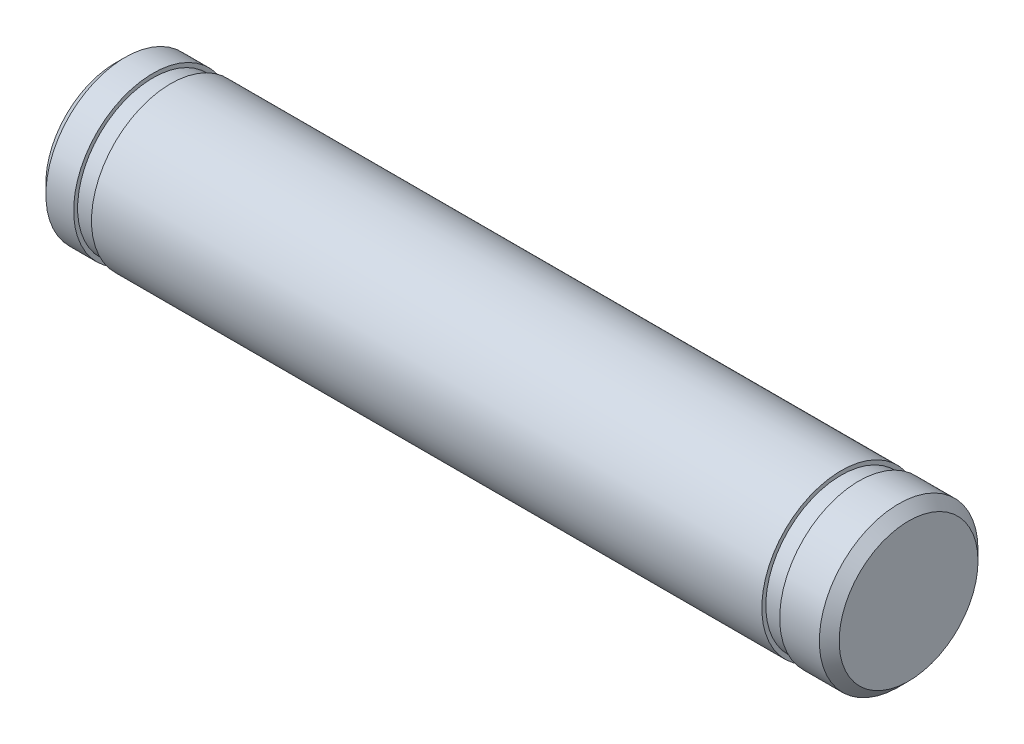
ISO-10303-21;
HEADER;
FILE_DESCRIPTION(('STEP AP214'),'2;1');
FILE_NAME('part.step','',(''),(''),'','','');
FILE_SCHEMA(('AUTOMOTIVE_DESIGN { 1 0 10303 214 1 1 1 1 }'));
ENDSEC;
DATA;
#1=APPLICATION_CONTEXT('core data for automotive mechanical design processes');
#2=APPLICATION_PROTOCOL_DEFINITION('international standard','automotive_design',2000,#1);
#3=PRODUCT_CONTEXT('',#1,'mechanical');
#4=PRODUCT('Part','Part','',(#3));
#5=PRODUCT_RELATED_PRODUCT_CATEGORY('part','',(#4));
#6=PRODUCT_DEFINITION_FORMATION('','',#4);
#7=PRODUCT_DEFINITION_CONTEXT('part definition',#1,'design');
#8=PRODUCT_DEFINITION('design','',#6,#7);
#9=PRODUCT_DEFINITION_SHAPE('','',#8);
#10=(LENGTH_UNIT() NAMED_UNIT(*) SI_UNIT(.MILLI.,.METRE.));
#11=(NAMED_UNIT(*) PLANE_ANGLE_UNIT() SI_UNIT($,.RADIAN.));
#12=(NAMED_UNIT(*) SI_UNIT($,.STERADIAN.) SOLID_ANGLE_UNIT());
#13=UNCERTAINTY_MEASURE_WITH_UNIT(LENGTH_MEASURE(1.E-05),#10,'distance_accuracy_value','');
#14=(GEOMETRIC_REPRESENTATION_CONTEXT(3) GLOBAL_UNCERTAINTY_ASSIGNED_CONTEXT((#13)) GLOBAL_UNIT_ASSIGNED_CONTEXT((#10,
#11,#12)) REPRESENTATION_CONTEXT('',''));
#15=CARTESIAN_POINT('',(0.,0.,0.));
#16=DIRECTION('',(0.,0.,1.));
#17=DIRECTION('',(1.,0.,0.));
#18=AXIS2_PLACEMENT_3D('',#15,#16,#17);
#19=CARTESIAN_POINT('',(0.,0.,0.));
#20=DIRECTION('',(-1.,0.,0.));
#21=DIRECTION('',(0.,0.,1.));
#22=AXIS2_PLACEMENT_3D('',#19,#20,#21);
#23=PLANE('',#22);
#24=CARTESIAN_POINT('',(0.,0.,0.));
#25=DIRECTION('',(1.,0.,0.));
#26=DIRECTION('',(0.,0.,-1.));
#27=AXIS2_PLACEMENT_3D('',#24,#25,#26);
#28=CIRCLE('',#27,3.49999999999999);
#29=CARTESIAN_POINT('',(0.,0.,-3.49999999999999));
#30=VERTEX_POINT('',#29);
#31=EDGE_CURVE('E10',#30,#30,#28,.T.);
#32=ORIENTED_EDGE('',*,*,#31,.F.);
#33=EDGE_LOOP('',(#32));
#34=FACE_BOUND('',#33,.T.);
#35=ADVANCED_FACE('F30',(#34),#23,.T.);
#36=CARTESIAN_POINT('',(0.499999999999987,0.,0.));
#37=DIRECTION('',(1.,0.,0.));
#38=DIRECTION('',(0.,0.,-1.));
#39=AXIS2_PLACEMENT_3D('',#36,#37,#38);
#40=CONICAL_SURFACE('',#39,3.99999999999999,0.785398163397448);
#41=ORIENTED_EDGE('',*,*,#31,.T.);
#42=EDGE_LOOP('',(#41));
#43=FACE_BOUND('',#42,.T.);
#44=CARTESIAN_POINT('',(0.499999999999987,0.,0.));
#45=DIRECTION('',(1.,0.,0.));
#46=DIRECTION('',(0.,0.,-1.));
#47=AXIS2_PLACEMENT_3D('',#44,#45,#46);
#48=CIRCLE('',#47,3.99999999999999);
#49=CARTESIAN_POINT('',(0.499999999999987,0.,-3.99999999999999));
#50=VERTEX_POINT('',#49);
#51=EDGE_CURVE('E36',#50,#50,#48,.T.);
#52=ORIENTED_EDGE('',*,*,#51,.F.);
#53=EDGE_LOOP('',(#52));
#54=FACE_BOUND('',#53,.T.);
#55=ADVANCED_FACE('F90',(#43,#54),#40,.T.);
#56=CARTESIAN_POINT('',(124.297135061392,0.,0.));
#57=DIRECTION('',(1.,0.,0.));
#58=DIRECTION('',(0.,0.,-1.));
#59=AXIS2_PLACEMENT_3D('',#56,#57,#58);
#60=CYLINDRICAL_SURFACE('',#59,3.99999999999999);
#61=ORIENTED_EDGE('',*,*,#51,.T.);
#62=EDGE_LOOP('',(#61));
#63=FACE_BOUND('',#62,.T.);
#64=CARTESIAN_POINT('',(1.89999999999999,0.,0.));
#65=DIRECTION('',(1.,0.,0.));
#66=DIRECTION('',(0.,0.,-1.));
#67=AXIS2_PLACEMENT_3D('',#64,#65,#66);
#68=CIRCLE('',#67,3.99999999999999);
#69=CARTESIAN_POINT('',(1.89999999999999,0.,-3.99999999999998));
#70=VERTEX_POINT('',#69);
#71=EDGE_CURVE('E40',#70,#70,#68,.T.);
#72=ORIENTED_EDGE('',*,*,#71,.F.);
#73=EDGE_LOOP('',(#72));
#74=FACE_BOUND('',#73,.T.);
#75=ADVANCED_FACE('F95',(#63,#74),#60,.T.);
#76=CARTESIAN_POINT('',(1.9,4.,0.));
#77=DIRECTION('',(1.,0.,0.));
#78=DIRECTION('',(0.,0.,-1.));
#79=AXIS2_PLACEMENT_3D('',#76,#77,#78);
#80=PLANE('',#79);
#81=ORIENTED_EDGE('',*,*,#71,.T.);
#82=EDGE_LOOP('',(#81));
#83=FACE_BOUND('',#82,.T.);
#84=CARTESIAN_POINT('',(1.89999999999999,0.,0.));
#85=DIRECTION('',(1.,0.,0.));
#86=DIRECTION('',(0.,0.,-1.));
#87=AXIS2_PLACEMENT_3D('',#84,#85,#86);
#88=CIRCLE('',#87,3.79999999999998);
#89=CARTESIAN_POINT('',(1.89999999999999,0.,-3.79999999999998));
#90=VERTEX_POINT('',#89);
#91=EDGE_CURVE('E44',#90,#90,#88,.T.);
#92=ORIENTED_EDGE('',*,*,#91,.F.);
#93=EDGE_LOOP('',(#92));
#94=FACE_BOUND('',#93,.T.);
#95=ADVANCED_FACE('F99',(#83,#94),#80,.T.);
#96=CARTESIAN_POINT('',(124.297135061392,0.,0.));
#97=DIRECTION('',(1.,0.,0.));
#98=DIRECTION('',(0.,0.,-1.));
#99=AXIS2_PLACEMENT_3D('',#96,#97,#98);
#100=CYLINDRICAL_SURFACE('',#99,3.79999999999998);
#101=ORIENTED_EDGE('',*,*,#91,.T.);
#102=EDGE_LOOP('',(#101));
#103=FACE_BOUND('',#102,.T.);
#104=CARTESIAN_POINT('',(2.79999999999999,0.,-2.22044604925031E-13));
#105=DIRECTION('',(1.,0.,0.));
#106=DIRECTION('',(0.,0.,-1.));
#107=AXIS2_PLACEMENT_3D('',#104,#105,#106);
#108=CIRCLE('',#107,3.79999999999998);
#109=CARTESIAN_POINT('',(2.79999999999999,0.,-3.80000000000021));
#110=VERTEX_POINT('',#109);
#111=EDGE_CURVE('E49',#110,#110,#108,.T.);
#112=ORIENTED_EDGE('',*,*,#111,.F.);
#113=EDGE_LOOP('',(#112));
#114=FACE_BOUND('',#113,.T.);
#115=ADVANCED_FACE('F105',(#103,#114),#100,.T.);
#116=CARTESIAN_POINT('',(2.79999999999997,3.99999999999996,-2.22044604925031E-13));
#117=DIRECTION('',(-1.,0.,0.));
#118=DIRECTION('',(0.,0.,1.));
#119=AXIS2_PLACEMENT_3D('',#116,#117,#118);
#120=PLANE('',#119);
#121=ORIENTED_EDGE('',*,*,#111,.T.);
#122=EDGE_LOOP('',(#121));
#123=FACE_BOUND('',#122,.T.);
#124=CARTESIAN_POINT('',(2.79999999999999,0.,-2.22044604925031E-13));
#125=DIRECTION('',(1.,0.,0.));
#126=DIRECTION('',(0.,0.,-1.));
#127=AXIS2_PLACEMENT_3D('',#124,#125,#126);
#128=CIRCLE('',#127,3.99999999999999);
#129=CARTESIAN_POINT('',(2.79999999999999,0.,-4.00000000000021));
#130=VERTEX_POINT('',#129);
#131=EDGE_CURVE('E52',#130,#130,#128,.T.);
#132=ORIENTED_EDGE('',*,*,#131,.F.);
#133=EDGE_LOOP('',(#132));
#134=FACE_BOUND('',#133,.T.);
#135=ADVANCED_FACE('F109',(#123,#134),#120,.T.);
#136=CARTESIAN_POINT('',(124.297135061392,0.,0.));
#137=DIRECTION('',(1.,0.,0.));
#138=DIRECTION('',(0.,0.,-1.));
#139=AXIS2_PLACEMENT_3D('',#136,#137,#138);
#140=CYLINDRICAL_SURFACE('',#139,3.99999999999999);
#141=ORIENTED_EDGE('',*,*,#131,.T.);
#142=EDGE_LOOP('',(#141));
#143=FACE_BOUND('',#142,.T.);
#144=CARTESIAN_POINT('',(36.6,0.,-2.22044604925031E-13));
#145=DIRECTION('',(1.,0.,0.));
#146=DIRECTION('',(0.,0.,-1.));
#147=AXIS2_PLACEMENT_3D('',#144,#145,#146);
#148=CIRCLE('',#147,3.99999999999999);
#149=CARTESIAN_POINT('',(36.6,0.,-4.00000000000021));
#150=VERTEX_POINT('',#149);
#151=EDGE_CURVE('E55',#150,#150,#148,.T.);
#152=ORIENTED_EDGE('',*,*,#151,.F.);
#153=EDGE_LOOP('',(#152));
#154=FACE_BOUND('',#153,.T.);
#155=ADVANCED_FACE('F113',(#143,#154),#140,.T.);
#156=CARTESIAN_POINT('',(36.6,3.99999999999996,-2.22044604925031E-13));
#157=DIRECTION('',(1.,0.,0.));
#158=DIRECTION('',(0.,0.,-1.));
#159=AXIS2_PLACEMENT_3D('',#156,#157,#158);
#160=PLANE('',#159);
#161=ORIENTED_EDGE('',*,*,#151,.T.);
#162=EDGE_LOOP('',(#161));
#163=FACE_BOUND('',#162,.T.);
#164=CARTESIAN_POINT('',(36.6,0.,-2.22044604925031E-13));
#165=DIRECTION('',(1.,0.,0.));
#166=DIRECTION('',(0.,0.,-1.));
#167=AXIS2_PLACEMENT_3D('',#164,#165,#166);
#168=CIRCLE('',#167,3.79999999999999);
#169=CARTESIAN_POINT('',(36.6,0.,-3.80000000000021));
#170=VERTEX_POINT('',#169);
#171=EDGE_CURVE('E58',#170,#170,#168,.T.);
#172=ORIENTED_EDGE('',*,*,#171,.F.);
#173=EDGE_LOOP('',(#172));
#174=FACE_BOUND('',#173,.T.);
#175=ADVANCED_FACE('F117',(#163,#174),#160,.T.);
#176=CARTESIAN_POINT('',(124.297135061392,0.,0.));
#177=DIRECTION('',(1.,0.,0.));
#178=DIRECTION('',(0.,0.,-1.));
#179=AXIS2_PLACEMENT_3D('',#176,#177,#178);
#180=CYLINDRICAL_SURFACE('',#179,3.79999999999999);
#181=ORIENTED_EDGE('',*,*,#171,.T.);
#182=EDGE_LOOP('',(#181));
#183=FACE_BOUND('',#182,.T.);
#184=CARTESIAN_POINT('',(37.5,0.,-2.22044604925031E-13));
#185=DIRECTION('',(1.,0.,0.));
#186=DIRECTION('',(0.,0.,-1.));
#187=AXIS2_PLACEMENT_3D('',#184,#185,#186);
#188=CIRCLE('',#187,3.79999999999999);
#189=CARTESIAN_POINT('',(37.5,0.,-3.80000000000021));
#190=VERTEX_POINT('',#189);
#191=EDGE_CURVE('E61',#190,#190,#188,.T.);
#192=ORIENTED_EDGE('',*,*,#191,.F.);
#193=EDGE_LOOP('',(#192));
#194=FACE_BOUND('',#193,.T.);
#195=ADVANCED_FACE('F121',(#183,#194),#180,.T.);
#196=CARTESIAN_POINT('',(37.5,3.99999999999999,-2.22044604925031E-13));
#197=DIRECTION('',(-1.,0.,0.));
#198=DIRECTION('',(0.,0.,1.));
#199=AXIS2_PLACEMENT_3D('',#196,#197,#198);
#200=PLANE('',#199);
#201=ORIENTED_EDGE('',*,*,#191,.T.);
#202=EDGE_LOOP('',(#201));
#203=FACE_BOUND('',#202,.T.);
#204=CARTESIAN_POINT('',(37.5,0.,-2.22044604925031E-13));
#205=DIRECTION('',(1.,0.,0.));
#206=DIRECTION('',(0.,0.,-1.));
#207=AXIS2_PLACEMENT_3D('',#204,#205,#206);
#208=CIRCLE('',#207,3.99999999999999);
#209=CARTESIAN_POINT('',(37.5,0.,-4.00000000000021));
#210=VERTEX_POINT('',#209);
#211=EDGE_CURVE('E64',#210,#210,#208,.T.);
#212=ORIENTED_EDGE('',*,*,#211,.F.);
#213=EDGE_LOOP('',(#212));
#214=FACE_BOUND('',#213,.T.);
#215=ADVANCED_FACE('F86',(#203,#214),#200,.T.);
#216=CARTESIAN_POINT('',(124.297135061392,0.,0.));
#217=DIRECTION('',(1.,0.,0.));
#218=DIRECTION('',(0.,0.,-1.));
#219=AXIS2_PLACEMENT_3D('',#216,#217,#218);
#220=CYLINDRICAL_SURFACE('',#219,3.99999999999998);
#221=ORIENTED_EDGE('',*,*,#211,.T.);
#222=EDGE_LOOP('',(#221));
#223=FACE_BOUND('',#222,.T.);
#224=CARTESIAN_POINT('',(39.5,0.,0.));
#225=DIRECTION('',(1.,0.,0.));
#226=DIRECTION('',(0.,0.,-1.));
#227=AXIS2_PLACEMENT_3D('',#224,#225,#226);
#228=CIRCLE('',#227,3.99999999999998);
#229=CARTESIAN_POINT('',(39.5,0.,-3.99999999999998));
#230=VERTEX_POINT('',#229);
#231=EDGE_CURVE('E67',#230,#230,#228,.T.);
#232=ORIENTED_EDGE('',*,*,#231,.F.);
#233=EDGE_LOOP('',(#232));
#234=FACE_BOUND('',#233,.T.);
#235=ADVANCED_FACE('F78',(#223,#234),#220,.T.);
#236=CARTESIAN_POINT('',(40.,0.,0.));
#237=DIRECTION('',(-1.,0.,0.));
#238=DIRECTION('',(0.,0.,1.));
#239=AXIS2_PLACEMENT_3D('',#236,#237,#238);
#240=CONICAL_SURFACE('',#239,3.49999999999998,0.785398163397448);
#241=ORIENTED_EDGE('',*,*,#231,.T.);
#242=EDGE_LOOP('',(#241));
#243=FACE_BOUND('',#242,.T.);
#244=CARTESIAN_POINT('',(40.,0.,0.));
#245=DIRECTION('',(1.,0.,0.));
#246=DIRECTION('',(0.,0.,-1.));
#247=AXIS2_PLACEMENT_3D('',#244,#245,#246);
#248=CIRCLE('',#247,3.49999999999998);
#249=CARTESIAN_POINT('',(40.,0.,-3.49999999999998));
#250=VERTEX_POINT('',#249);
#251=EDGE_CURVE('E70',#250,#250,#248,.T.);
#252=ORIENTED_EDGE('',*,*,#251,.F.);
#253=EDGE_LOOP('',(#252));
#254=FACE_BOUND('',#253,.T.);
#255=ADVANCED_FACE('F76',(#243,#254),#240,.T.);
#256=CARTESIAN_POINT('',(40.,0.,0.));
#257=DIRECTION('',(1.,0.,0.));
#258=DIRECTION('',(0.,0.,-1.));
#259=AXIS2_PLACEMENT_3D('',#256,#257,#258);
#260=PLANE('',#259);
#261=ORIENTED_EDGE('',*,*,#251,.T.);
#262=EDGE_LOOP('',(#261));
#263=FACE_BOUND('',#262,.T.);
#264=ADVANCED_FACE('F74',(#263),#260,.T.);
#265=CLOSED_SHELL('',(#35,#55,#75,#95,#115,#135,#155,#175,#195,#215,#235,#255,#264));
#266=MANIFOLD_SOLID_BREP('B2',#265);
#267=ADVANCED_BREP_SHAPE_REPRESENTATION('',(#18,#266),#14);
#268=SHAPE_DEFINITION_REPRESENTATION(#9,#267);
ENDSEC;
END-ISO-10303-21;
